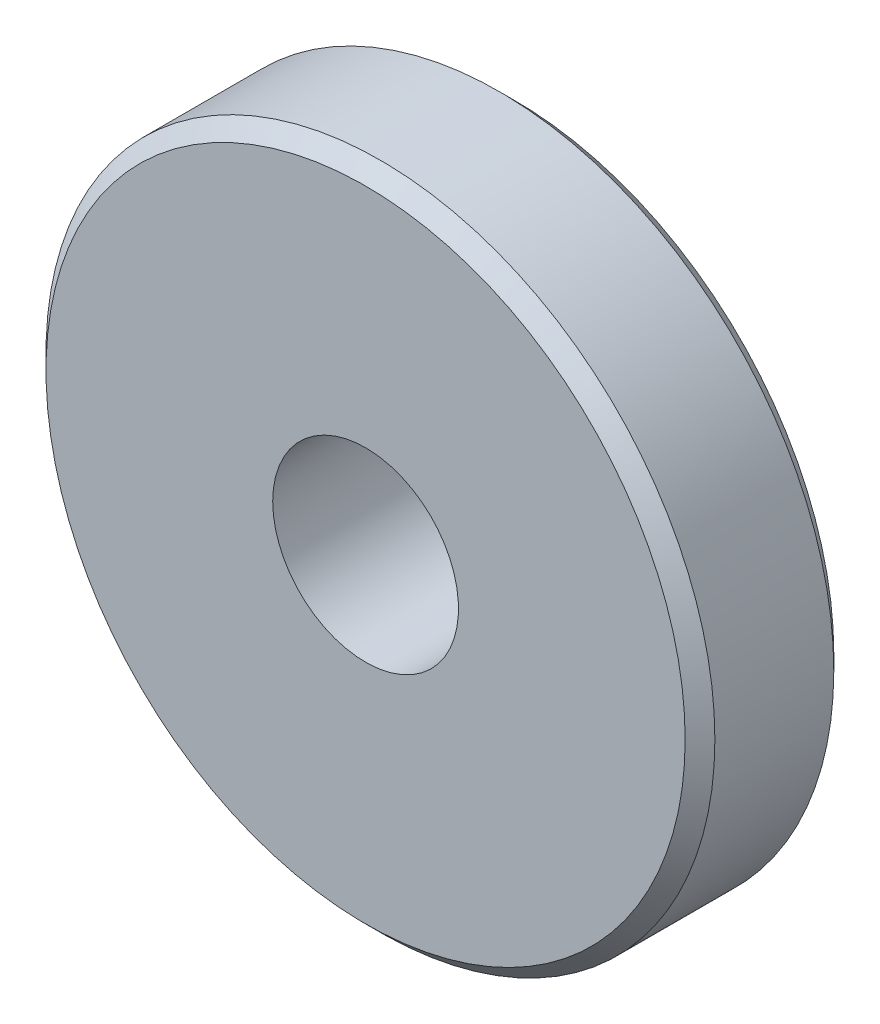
ISO-10303-21;
HEADER;
FILE_DESCRIPTION(('STEP AP214'),'2;1');
FILE_NAME('part.step','',(''),(''),'','','');
FILE_SCHEMA(('AUTOMOTIVE_DESIGN { 1 0 10303 214 1 1 1 1 }'));
ENDSEC;
DATA;
#1=APPLICATION_CONTEXT('core data for automotive mechanical design processes');
#2=APPLICATION_PROTOCOL_DEFINITION('international standard','automotive_design',2000,#1);
#3=PRODUCT_CONTEXT('',#1,'mechanical');
#4=PRODUCT('Part','Part','',(#3));
#5=PRODUCT_RELATED_PRODUCT_CATEGORY('part','',(#4));
#6=PRODUCT_DEFINITION_FORMATION('','',#4);
#7=PRODUCT_DEFINITION_CONTEXT('part definition',#1,'design');
#8=PRODUCT_DEFINITION('design','',#6,#7);
#9=PRODUCT_DEFINITION_SHAPE('','',#8);
#10=(LENGTH_UNIT() NAMED_UNIT(*) SI_UNIT(.MILLI.,.METRE.));
#11=(NAMED_UNIT(*) PLANE_ANGLE_UNIT() SI_UNIT($,.RADIAN.));
#12=(NAMED_UNIT(*) SI_UNIT($,.STERADIAN.) SOLID_ANGLE_UNIT());
#13=UNCERTAINTY_MEASURE_WITH_UNIT(LENGTH_MEASURE(1.E-05),#10,'distance_accuracy_value','');
#14=(GEOMETRIC_REPRESENTATION_CONTEXT(3) GLOBAL_UNCERTAINTY_ASSIGNED_CONTEXT((#13)) GLOBAL_UNIT_ASSIGNED_CONTEXT((#10,
#11,#12)) REPRESENTATION_CONTEXT('',''));
#15=CARTESIAN_POINT('',(0.,0.,0.));
#16=DIRECTION('',(0.,0.,1.));
#17=DIRECTION('',(1.,0.,0.));
#18=AXIS2_PLACEMENT_3D('',#15,#16,#17);
#19=CARTESIAN_POINT('',(0.,0.,2.));
#20=DIRECTION('',(0.,0.,-1.));
#21=DIRECTION('',(-1.,0.,0.));
#22=AXIS2_PLACEMENT_3D('',#19,#20,#21);
#23=CYLINDRICAL_SURFACE('',#22,10.);
#24=CARTESIAN_POINT('',(0.,0.,1.51));
#25=DIRECTION('',(0.,0.,1.));
#26=DIRECTION('',(1.,0.,0.));
#27=AXIS2_PLACEMENT_3D('',#24,#25,#26);
#28=CIRCLE('',#27,10.);
#29=CARTESIAN_POINT('',(10.,0.,1.51));
#30=VERTEX_POINT('',#29);
#31=EDGE_CURVE('E8',#30,#30,#28,.F.);
#32=ORIENTED_EDGE('',*,*,#31,.T.);
#33=EDGE_LOOP('',(#32));
#34=FACE_BOUND('',#33,.T.);
#35=CARTESIAN_POINT('',(0.,0.,0.));
#36=DIRECTION('',(0.,0.,1.));
#37=DIRECTION('',(1.,0.,0.));
#38=AXIS2_PLACEMENT_3D('',#35,#36,#37);
#39=CIRCLE('',#38,10.);
#40=CARTESIAN_POINT('',(10.,0.,0.));
#41=VERTEX_POINT('',#40);
#42=EDGE_CURVE('E38',#41,#41,#39,.T.);
#43=ORIENTED_EDGE('',*,*,#42,.T.);
#44=EDGE_LOOP('',(#43));
#45=FACE_BOUND('',#44,.T.);
#46=ADVANCED_FACE('F12',(#34,#45),#23,.T.);
#47=CARTESIAN_POINT('',(0.,0.,0.));
#48=DIRECTION('',(0.,0.,1.));
#49=DIRECTION('',(1.,0.,0.));
#50=AXIS2_PLACEMENT_3D('',#47,#48,#49);
#51=PLANE('',#50);
#52=CARTESIAN_POINT('',(0.,0.,0.));
#53=DIRECTION('',(0.,0.,-1.));
#54=DIRECTION('',(-1.,0.,0.));
#55=AXIS2_PLACEMENT_3D('',#52,#53,#54);
#56=CIRCLE('',#55,5.);
#57=CARTESIAN_POINT('',(-5.,0.,0.));
#58=VERTEX_POINT('',#57);
#59=EDGE_CURVE('E42',#58,#58,#56,.T.);
#60=ORIENTED_EDGE('',*,*,#59,.F.);
#61=EDGE_LOOP('',(#60));
#62=FACE_BOUND('',#61,.T.);
#63=ORIENTED_EDGE('',*,*,#42,.F.);
#64=EDGE_LOOP('',(#63));
#65=FACE_BOUND('',#64,.T.);
#66=ADVANCED_FACE('F57',(#62,#65),#51,.F.);
#67=CARTESIAN_POINT('',(0.,0.,2.));
#68=DIRECTION('',(0.,0.,1.));
#69=DIRECTION('',(1.,0.,0.));
#70=AXIS2_PLACEMENT_3D('',#67,#68,#69);
#71=PLANE('',#70);
#72=CARTESIAN_POINT('',(0.,0.,2.));
#73=DIRECTION('',(0.,0.,1.));
#74=DIRECTION('',(1.,0.,0.));
#75=AXIS2_PLACEMENT_3D('',#72,#73,#74);
#76=CIRCLE('',#75,10.49);
#77=CARTESIAN_POINT('',(10.49,0.,2.));
#78=VERTEX_POINT('',#77);
#79=EDGE_CURVE('E19',#78,#78,#76,.T.);
#80=ORIENTED_EDGE('',*,*,#79,.T.);
#81=EDGE_LOOP('',(#80));
#82=FACE_BOUND('',#81,.T.);
#83=CARTESIAN_POINT('',(0.,0.,2.));
#84=DIRECTION('',(0.,0.,1.));
#85=DIRECTION('',(1.,0.,0.));
#86=AXIS2_PLACEMENT_3D('',#83,#84,#85);
#87=CIRCLE('',#86,17.2);
#88=CARTESIAN_POINT('',(17.2,0.,2.));
#89=VERTEX_POINT('',#88);
#90=EDGE_CURVE('E27',#89,#89,#87,.F.);
#91=ORIENTED_EDGE('',*,*,#90,.T.);
#92=EDGE_LOOP('',(#91));
#93=FACE_BOUND('',#92,.T.);
#94=ADVANCED_FACE('F60',(#82,#93),#71,.F.);
#95=CARTESIAN_POINT('',(0.,0.,10.));
#96=DIRECTION('',(0.,0.,-1.));
#97=DIRECTION('',(-1.,0.,0.));
#98=AXIS2_PLACEMENT_3D('',#95,#96,#97);
#99=CYLINDRICAL_SURFACE('',#98,18.);
#100=CARTESIAN_POINT('',(0.,0.,2.8));
#101=DIRECTION('',(0.,0.,1.));
#102=DIRECTION('',(1.,0.,0.));
#103=AXIS2_PLACEMENT_3D('',#100,#101,#102);
#104=CIRCLE('',#103,18.);
#105=CARTESIAN_POINT('',(18.,0.,2.8));
#106=VERTEX_POINT('',#105);
#107=EDGE_CURVE('E32',#106,#106,#104,.T.);
#108=ORIENTED_EDGE('',*,*,#107,.T.);
#109=EDGE_LOOP('',(#108));
#110=FACE_BOUND('',#109,.T.);
#111=CARTESIAN_POINT('',(0.,0.,9.2));
#112=DIRECTION('',(0.,0.,1.));
#113=DIRECTION('',(1.,0.,0.));
#114=AXIS2_PLACEMENT_3D('',#111,#112,#113);
#115=CIRCLE('',#114,18.);
#116=CARTESIAN_POINT('',(18.,0.,9.2));
#117=VERTEX_POINT('',#116);
#118=EDGE_CURVE('E35',#117,#117,#115,.F.);
#119=ORIENTED_EDGE('',*,*,#118,.T.);
#120=EDGE_LOOP('',(#119));
#121=FACE_BOUND('',#120,.T.);
#122=ADVANCED_FACE('F87',(#110,#121),#99,.T.);
#123=CARTESIAN_POINT('',(0.,0.,10.));
#124=DIRECTION('',(0.,0.,1.));
#125=DIRECTION('',(1.,0.,0.));
#126=AXIS2_PLACEMENT_3D('',#123,#124,#125);
#127=PLANE('',#126);
#128=CARTESIAN_POINT('',(0.,0.,10.));
#129=DIRECTION('',(0.,0.,1.));
#130=DIRECTION('',(1.,0.,0.));
#131=AXIS2_PLACEMENT_3D('',#128,#129,#130);
#132=CIRCLE('',#131,17.2);
#133=CARTESIAN_POINT('',(17.2,0.,10.));
#134=VERTEX_POINT('',#133);
#135=EDGE_CURVE('E23',#134,#134,#132,.T.);
#136=ORIENTED_EDGE('',*,*,#135,.T.);
#137=EDGE_LOOP('',(#136));
#138=FACE_BOUND('',#137,.T.);
#139=CARTESIAN_POINT('',(0.,0.,10.));
#140=DIRECTION('',(0.,0.,-1.));
#141=DIRECTION('',(-1.,0.,0.));
#142=AXIS2_PLACEMENT_3D('',#139,#140,#141);
#143=CIRCLE('',#142,5.);
#144=CARTESIAN_POINT('',(-5.,0.,10.));
#145=VERTEX_POINT('',#144);
#146=EDGE_CURVE('E41',#145,#145,#143,.T.);
#147=ORIENTED_EDGE('',*,*,#146,.T.);
#148=EDGE_LOOP('',(#147));
#149=FACE_BOUND('',#148,.T.);
#150=ADVANCED_FACE('F48',(#138,#149),#127,.T.);
#151=CARTESIAN_POINT('',(0.,0.,10.));
#152=DIRECTION('',(0.,0.,-1.));
#153=DIRECTION('',(-1.,0.,0.));
#154=AXIS2_PLACEMENT_3D('',#151,#152,#153);
#155=CYLINDRICAL_SURFACE('',#154,5.);
#156=ORIENTED_EDGE('',*,*,#146,.F.);
#157=EDGE_LOOP('',(#156));
#158=FACE_BOUND('',#157,.T.);
#159=ORIENTED_EDGE('',*,*,#59,.T.);
#160=EDGE_LOOP('',(#159));
#161=FACE_BOUND('',#160,.T.);
#162=ADVANCED_FACE('F50',(#158,#161),#155,.F.);
#163=CARTESIAN_POINT('',(0.,0.,2.8));
#164=DIRECTION('',(0.,0.,1.));
#165=DIRECTION('',(1.,0.,0.));
#166=AXIS2_PLACEMENT_3D('',#163,#164,#165);
#167=CONICAL_SURFACE('',#166,18.,0.785398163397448);
#168=ORIENTED_EDGE('',*,*,#90,.F.);
#169=EDGE_LOOP('',(#168));
#170=FACE_BOUND('',#169,.T.);
#171=ORIENTED_EDGE('',*,*,#107,.F.);
#172=EDGE_LOOP('',(#171));
#173=FACE_BOUND('',#172,.T.);
#174=ADVANCED_FACE('F53',(#170,#173),#167,.T.);
#175=CARTESIAN_POINT('',(0.,0.,10.));
#176=DIRECTION('',(0.,0.,-1.));
#177=DIRECTION('',(-1.,0.,0.));
#178=AXIS2_PLACEMENT_3D('',#175,#176,#177);
#179=CONICAL_SURFACE('',#178,17.2,0.785398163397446);
#180=ORIENTED_EDGE('',*,*,#118,.F.);
#181=EDGE_LOOP('',(#180));
#182=FACE_BOUND('',#181,.T.);
#183=ORIENTED_EDGE('',*,*,#135,.F.);
#184=EDGE_LOOP('',(#183));
#185=FACE_BOUND('',#184,.T.);
#186=ADVANCED_FACE('F73',(#182,#185),#179,.T.);
#187=CARTESIAN_POINT('',(0.,0.,1.51));
#188=DIRECTION('',(0.,0.,1.));
#189=DIRECTION('',(1.,0.,0.));
#190=AXIS2_PLACEMENT_3D('',#187,#188,#189);
#191=TOROIDAL_SURFACE('',#190,10.49,0.49);
#192=ORIENTED_EDGE('',*,*,#31,.F.);
#193=EDGE_LOOP('',(#192));
#194=FACE_BOUND('',#193,.T.);
#195=ORIENTED_EDGE('',*,*,#79,.F.);
#196=EDGE_LOOP('',(#195));
#197=FACE_BOUND('',#196,.T.);
#198=ADVANCED_FACE('F14',(#194,#197),#191,.F.);
#199=CLOSED_SHELL('',(#46,#66,#94,#122,#150,#162,#174,#186,#198));
#200=MANIFOLD_SOLID_BREP('B1',#199);
#201=ADVANCED_BREP_SHAPE_REPRESENTATION('',(#18,#200),#14);
#202=SHAPE_DEFINITION_REPRESENTATION(#9,#201);
ENDSEC;
END-ISO-10303-21;
